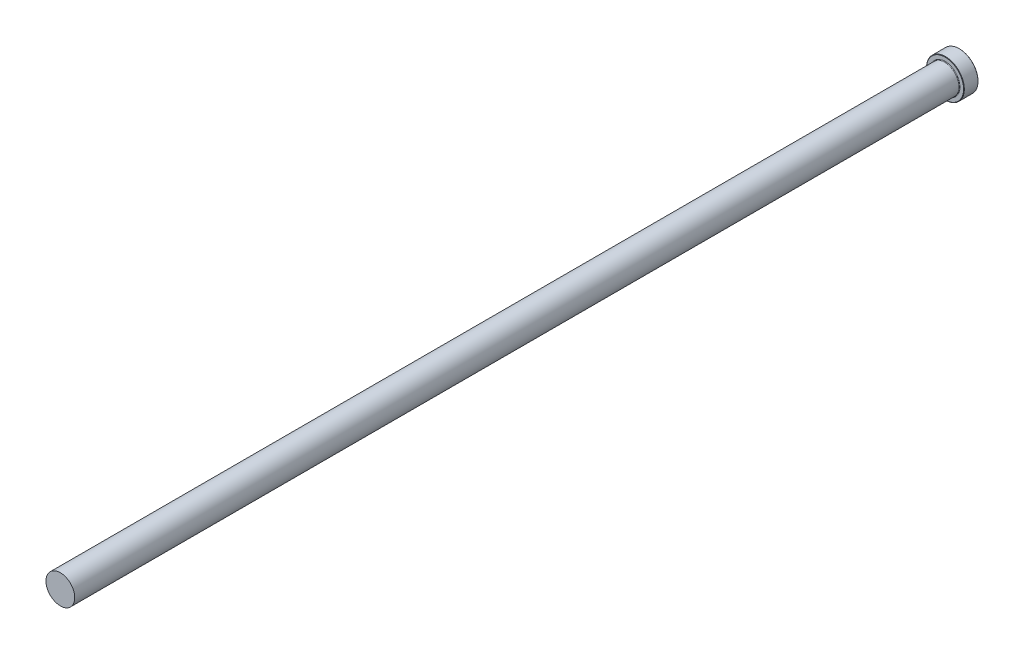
from build123d import *

# Parameters (mm, degrees)
CHAMFER1_SIZE = 0.2


with BuildPart() as part:
    # Sketch1 → Revolve1 (revolve)
    with BuildSketch(Plane(origin=(0, 0, 0), x_dir=(0, 0, -1), z_dir=(1, 0, 0)), mode=Mode.PRIVATE) as revolve1_sk:
        with BuildLine():
            Line((0, 0), (0, 10.5))
            Line((0, 10.5), (-8, 10.5))
            Line((-8, 10.5), (-8, 8.3))
            ThreePointArc((-8, 8.3), (-8.087867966, 8.087867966), (-8.3, 8))
            Line((-8.3, 8), (-500, 8))
            Line((-500, 8), (-500, 0))
            Line((-500, 0), (0, 0))
        make_face()
    revolve(revolve1_sk.sketch.rotate(Axis((0, 0, 109.05062828), (0, 0, -1)), 90), axis=Axis((0, 0, 109.05062828), (0, 0, -1)))

    # Chamfer1
    chamfer1_edges = [part.edges().sort_by_distance(p)[0] for p in [
        (-10.5, 0, 0),
        (-10.5, 0, 8),
    ]]
    chamfer(chamfer1_edges, length=CHAMFER1_SIZE)


solid = part.part
